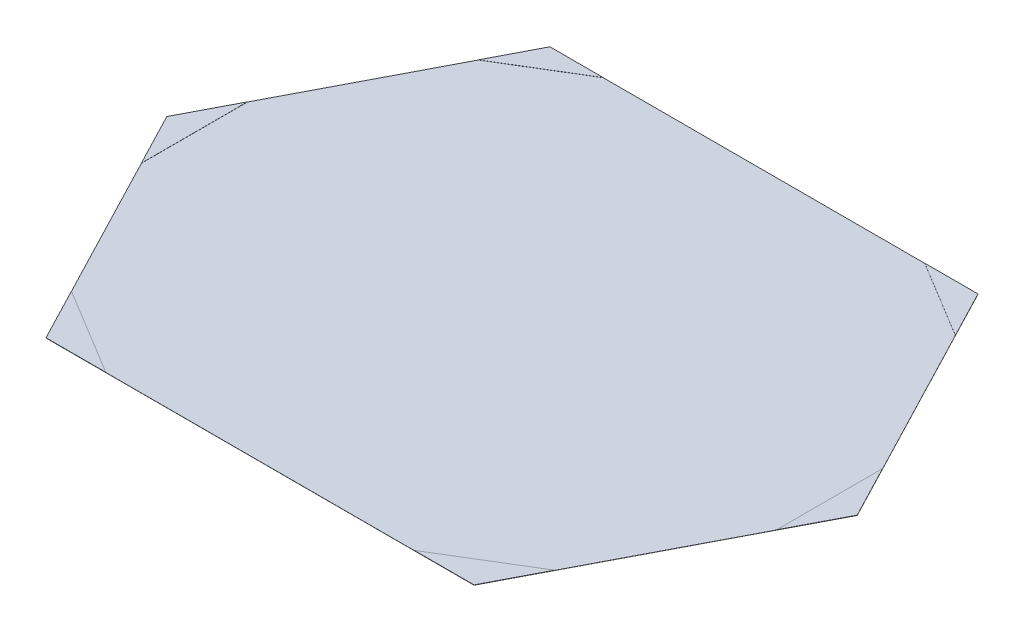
from build123d import *

# Parameters (mm, degrees)
BOSS_EXTRU_1_DEPTH = 1
BOSS_EXTRU_2_DEPTH = 1


with BuildPart() as part:
    # Esquisse1 → Boss.-Extru.1 (new body)
    with BuildSketch(Plane(origin=(0, 0, 0), x_dir=(1, 0, 0), z_dir=(0, 1, 0))):
        Polygon((0, 0), (950, 1825), (4050, 1825), (5000, 0), (4050, -1825), (950, -1825), align=None)
    extrude(amount=BOSS_EXTRU_1_DEPTH)

    # Esquisse2 → Boss.-Extru.2 (add)
    with BuildSketch(Plane(origin=(0, 1, 0), x_dir=(1, 0, 0), z_dir=(0, 1, 0))):
        Polygon((200, -384.210526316), (200, 384.210526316), (0, 0), align=None)
        Polygon((4250, -1440.789473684), (3616.851378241, -1825), (4050, -1825), align=None)
        Polygon((1383.148621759, -1825), (750, -1440.789473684), (950, -1825), align=None)
        Polygon((771.991764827, 1483.036811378), (1335.520108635, 1825), (950, 1825), align=None)
        Polygon((3664.479891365, 1825), (4050, 1825), (4228.008235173, 1483.036811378), align=None)
        Polygon((4800, 384.210526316), (5000, 0), (4800, -384.210526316), align=None)
    extrude(amount=BOSS_EXTRU_2_DEPTH)


solid = part.part
